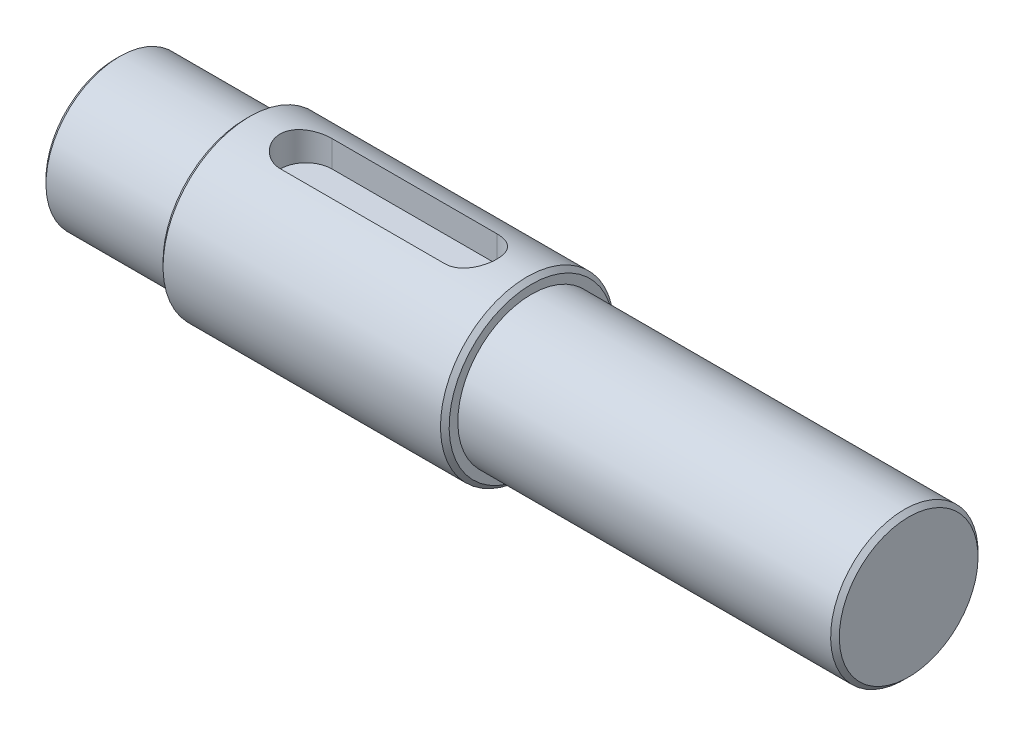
ISO-10303-21;
HEADER;
FILE_DESCRIPTION(('STEP AP214'),'2;1');
FILE_NAME('part.step','',(''),(''),'','','');
FILE_SCHEMA(('AUTOMOTIVE_DESIGN { 1 0 10303 214 1 1 1 1 }'));
ENDSEC;
DATA;
#1=APPLICATION_CONTEXT('core data for automotive mechanical design processes');
#2=APPLICATION_PROTOCOL_DEFINITION('international standard','automotive_design',2000,#1);
#3=PRODUCT_CONTEXT('',#1,'mechanical');
#4=PRODUCT('Part','Part','',(#3));
#5=PRODUCT_RELATED_PRODUCT_CATEGORY('part','',(#4));
#6=PRODUCT_DEFINITION_FORMATION('','',#4);
#7=PRODUCT_DEFINITION_CONTEXT('part definition',#1,'design');
#8=PRODUCT_DEFINITION('design','',#6,#7);
#9=PRODUCT_DEFINITION_SHAPE('','',#8);
#10=(LENGTH_UNIT() NAMED_UNIT(*) SI_UNIT(.MILLI.,.METRE.));
#11=(NAMED_UNIT(*) PLANE_ANGLE_UNIT() SI_UNIT($,.RADIAN.));
#12=(NAMED_UNIT(*) SI_UNIT($,.STERADIAN.) SOLID_ANGLE_UNIT());
#13=UNCERTAINTY_MEASURE_WITH_UNIT(LENGTH_MEASURE(1.E-05),#10,'distance_accuracy_value','');
#14=(GEOMETRIC_REPRESENTATION_CONTEXT(3) GLOBAL_UNCERTAINTY_ASSIGNED_CONTEXT((#13)) GLOBAL_UNIT_ASSIGNED_CONTEXT((#10,
#11,#12)) REPRESENTATION_CONTEXT('',''));
#15=CARTESIAN_POINT('',(0.,0.,0.));
#16=DIRECTION('',(0.,0.,1.));
#17=DIRECTION('',(1.,0.,0.));
#18=AXIS2_PLACEMENT_3D('',#15,#16,#17);
#19=CARTESIAN_POINT('',(91.5,0.,0.));
#20=DIRECTION('',(1.,0.,0.));
#21=DIRECTION('',(0.,1.,0.));
#22=AXIS2_PLACEMENT_3D('',#19,#20,#21);
#23=CYLINDRICAL_SURFACE('',#22,9.99999999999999);
#24=CARTESIAN_POINT('',(15.5,0.,0.));
#25=DIRECTION('',(1.,0.,0.));
#26=DIRECTION('',(0.,1.,0.));
#27=AXIS2_PLACEMENT_3D('',#24,#25,#26);
#28=CIRCLE('',#27,9.99999999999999);
#29=CARTESIAN_POINT('',(15.5,9.99999999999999,0.));
#30=VERTEX_POINT('',#29);
#31=EDGE_CURVE('E192',#30,#30,#28,.T.);
#32=ORIENTED_EDGE('',*,*,#31,.T.);
#33=EDGE_LOOP('',(#32));
#34=FACE_BOUND('',#33,.T.);
#35=CARTESIAN_POINT('',(47.5,0.,0.));
#36=DIRECTION('',(1.,0.,0.));
#37=DIRECTION('',(0.,1.,0.));
#38=AXIS2_PLACEMENT_3D('',#35,#36,#37);
#39=CIRCLE('',#38,9.99999999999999);
#40=CARTESIAN_POINT('',(47.5,9.99999999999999,0.));
#41=VERTEX_POINT('',#40);
#42=EDGE_CURVE('E195',#41,#41,#39,.T.);
#43=ORIENTED_EDGE('',*,*,#42,.F.);
#44=EDGE_LOOP('',(#43));
#45=FACE_BOUND('',#44,.T.);
#46=DIRECTION('',(1.,0.,0.));
#47=VECTOR('',#46,1.);
#48=CARTESIAN_POINT('',(91.5,9.53939201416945,2.99999999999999));
#49=LINE('',#48,#47);
#50=CARTESIAN_POINT('',(22.,9.53939201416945,3.));
#51=VERTEX_POINT('',#50);
#52=CARTESIAN_POINT('',(41.,9.53939201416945,3.));
#53=VERTEX_POINT('',#52);
#54=EDGE_CURVE('E109',#51,#53,#49,.T.);
#55=ORIENTED_EDGE('',*,*,#54,.F.);
#56=CARTESIAN_POINT('',(22.,9.53939201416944,-3.));
#57=CARTESIAN_POINT('',(21.9176644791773,9.53938054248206,-3.00001027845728));
#58=CARTESIAN_POINT('',(21.8353355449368,9.54045772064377,-2.99661062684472));
#59=CARTESIAN_POINT('',(21.6713060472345,9.54470412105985,-2.98307142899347));
#60=CARTESIAN_POINT('',(21.5896053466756,9.54787287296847,-2.97293339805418));
#61=CARTESIAN_POINT('',(21.4276150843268,9.55620668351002,-2.94603140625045));
#62=CARTESIAN_POINT('',(21.347322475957,9.56136667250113,-2.92928426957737));
#63=CARTESIAN_POINT('',(21.1885241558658,9.57351626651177,-2.88932853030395));
#64=CARTESIAN_POINT('',(21.1100184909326,9.58050591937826,-2.86611975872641));
#65=CARTESIAN_POINT('',(20.8780506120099,9.60391637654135,-2.78708584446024));
#66=CARTESIAN_POINT('',(20.727931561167,9.62279007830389,-2.72181852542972));
#67=CARTESIAN_POINT('',(20.440773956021,9.66493213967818,-2.56815043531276));
#68=CARTESIAN_POINT('',(20.3037415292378,9.6882025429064,-2.4797388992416));
#69=CARTESIAN_POINT('',(20.0422770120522,9.73733650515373,-2.27929879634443));
#70=CARTESIAN_POINT('',(19.9183151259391,9.76325505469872,-2.16666914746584));
#71=CARTESIAN_POINT('',(19.6907263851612,9.81429628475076,-1.92227736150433));
#72=CARTESIAN_POINT('',(19.587102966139,9.83941883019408,-1.79051199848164));
#73=CARTESIAN_POINT('',(19.4010731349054,9.88666477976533,-1.50821997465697));
#74=CARTESIAN_POINT('',(19.3191498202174,9.90871541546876,-1.35736167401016));
#75=CARTESIAN_POINT('',(19.1820229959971,9.94668940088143,-1.04324233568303));
#76=CARTESIAN_POINT('',(19.126812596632,9.96261433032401,-0.879984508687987));
#77=CARTESIAN_POINT('',(19.046240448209,9.98615279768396,-0.550649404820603));
#78=CARTESIAN_POINT('',(19.0200702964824,9.99399098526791,-0.384786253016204));
#79=CARTESIAN_POINT('',(18.995765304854,10.0012640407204,-0.0508471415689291));
#80=CARTESIAN_POINT('',(18.9976251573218,10.0007004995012,0.117228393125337));
#81=CARTESIAN_POINT('',(19.0287858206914,9.99139205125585,0.445143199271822));
#82=CARTESIAN_POINT('',(19.0572106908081,9.98290831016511,0.605074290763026));
#83=CARTESIAN_POINT('',(19.1392632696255,9.95903027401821,0.917780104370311));
#84=CARTESIAN_POINT('',(19.1928922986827,9.94363561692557,1.07055445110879));
#85=CARTESIAN_POINT('',(19.3244244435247,9.90730429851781,1.36669563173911));
#86=CARTESIAN_POINT('',(19.4026032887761,9.88630511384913,1.50993201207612));
#87=CARTESIAN_POINT('',(19.5807971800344,9.84099249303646,1.781531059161));
#88=CARTESIAN_POINT('',(19.6808171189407,9.81667831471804,1.9098903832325));
#89=CARTESIAN_POINT('',(19.9043839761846,9.76623347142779,2.15330901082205));
#90=CARTESIAN_POINT('',(20.0286877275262,9.74006890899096,2.26766702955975));
#91=CARTESIAN_POINT('',(20.2949948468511,9.68968430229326,2.47413538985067));
#92=CARTESIAN_POINT('',(20.4370033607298,9.66546482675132,2.5662392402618));
#93=CARTESIAN_POINT('',(20.7365618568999,9.62154457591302,2.72632814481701));
#94=CARTESIAN_POINT('',(20.8942543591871,9.60189192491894,2.79406012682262));
#95=CARTESIAN_POINT('',(21.2194490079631,9.56991327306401,2.90171772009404));
#96=CARTESIAN_POINT('',(21.3869357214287,9.55757606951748,2.94168586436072));
#97=CARTESIAN_POINT('',(21.6299897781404,9.5462806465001,2.97802407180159));
#98=CARTESIAN_POINT('',(21.7037814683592,9.54370312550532,2.98626405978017));
#99=CARTESIAN_POINT('',(21.851702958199,9.54025857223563,2.99724711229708));
#100=CARTESIAN_POINT('',(21.9258320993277,9.53938902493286,2.99999825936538));
#101=CARTESIAN_POINT('',(22.,9.53939201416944,3.));
#102=B_SPLINE_CURVE_WITH_KNOTS('',3,(#56,#57,#58,#59,#60,#61,#62,#63,#64,#65,#66,#67,#68,#69,
#70,#71,#72,#73,#74,#75,#76,#77,#78,#79,#80,#81,#82,#83,#84,#85,#86,#87,#88,#89,#90,#91,#92,#93,
#94,#95,#96,#97,#98,#99,#100,#101),.UNSPECIFIED.,.F.,.F.,(4,2,2,2,2,2,2,2,2,2,2,2,2,2,2,2,2,2,2,
2,2,2,4),(0.,0.246918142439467,0.493780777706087,0.740019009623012,0.986263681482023,
1.47813347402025,1.97023245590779,2.47635119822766,2.98255536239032,3.4992281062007,
4.01576751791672,4.51753600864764,5.019209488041,5.50490358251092,5.99062312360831,
6.48200583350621,6.97349873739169,7.48389234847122,7.99443465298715,8.51013494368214,
9.02504345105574,9.24774267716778,9.47011372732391),.UNSPECIFIED.);
#103=CARTESIAN_POINT('',(22.,9.53939201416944,-3.00000000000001));
#104=VERTEX_POINT('',#103);
#105=EDGE_CURVE('E91',#104,#51,#102,.T.);
#106=ORIENTED_EDGE('',*,*,#105,.F.);
#107=DIRECTION('',(1.,0.,0.));
#108=VECTOR('',#107,1.);
#109=CARTESIAN_POINT('',(91.5,9.53939201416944,-3.00000000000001));
#110=LINE('',#109,#108);
#111=CARTESIAN_POINT('',(41.,9.53939201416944,-3.00000000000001));
#112=VERTEX_POINT('',#111);
#113=EDGE_CURVE('E103',#112,#104,#110,.F.);
#114=ORIENTED_EDGE('',*,*,#113,.F.);
#115=CARTESIAN_POINT('',(41.,9.53939201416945,3.));
#116=CARTESIAN_POINT('',(41.0823355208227,9.53938054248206,3.00001027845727));
#117=CARTESIAN_POINT('',(41.1646644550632,9.54045772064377,2.99661062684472));
#118=CARTESIAN_POINT('',(41.3286939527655,9.54470412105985,2.98307142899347));
#119=CARTESIAN_POINT('',(41.4103946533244,9.54787287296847,2.97293339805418));
#120=CARTESIAN_POINT('',(41.5723849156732,9.55620668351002,2.94603140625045));
#121=CARTESIAN_POINT('',(41.652677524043,9.56136667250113,2.92928426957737));
#122=CARTESIAN_POINT('',(41.8114758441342,9.57351626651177,2.88932853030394));
#123=CARTESIAN_POINT('',(41.8899815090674,9.58050591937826,2.8661197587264));
#124=CARTESIAN_POINT('',(42.1219493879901,9.60391637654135,2.78708584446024));
#125=CARTESIAN_POINT('',(42.272068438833,9.6227900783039,2.72181852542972));
#126=CARTESIAN_POINT('',(42.559226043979,9.66493213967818,2.56815043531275));
#127=CARTESIAN_POINT('',(42.6962584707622,9.6882025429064,2.47973889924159));
#128=CARTESIAN_POINT('',(42.9577229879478,9.73733650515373,2.27929879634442));
#129=CARTESIAN_POINT('',(43.0816848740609,9.76325505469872,2.16666914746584));
#130=CARTESIAN_POINT('',(43.3092736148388,9.81429628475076,1.92227736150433));
#131=CARTESIAN_POINT('',(43.412897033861,9.83941883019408,1.79051199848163));
#132=CARTESIAN_POINT('',(43.5989268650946,9.88666477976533,1.50821997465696));
#133=CARTESIAN_POINT('',(43.6808501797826,9.90871541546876,1.35736167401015));
#134=CARTESIAN_POINT('',(43.8179770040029,9.94668940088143,1.04324233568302));
#135=CARTESIAN_POINT('',(43.873187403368,9.96261433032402,0.879984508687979));
#136=CARTESIAN_POINT('',(43.953759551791,9.98615279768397,0.550649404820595));
#137=CARTESIAN_POINT('',(43.9799297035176,9.99399098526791,0.384786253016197));
#138=CARTESIAN_POINT('',(44.004234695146,10.0012640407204,0.0508471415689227));
#139=CARTESIAN_POINT('',(44.0023748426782,10.0007004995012,-0.117228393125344));
#140=CARTESIAN_POINT('',(43.9712141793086,9.99139205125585,-0.445143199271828));
#141=CARTESIAN_POINT('',(43.9427893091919,9.98290831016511,-0.605074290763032));
#142=CARTESIAN_POINT('',(43.8607367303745,9.95903027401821,-0.917780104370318));
#143=CARTESIAN_POINT('',(43.8071077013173,9.94363561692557,-1.07055445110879));
#144=CARTESIAN_POINT('',(43.6755755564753,9.90730429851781,-1.36669563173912));
#145=CARTESIAN_POINT('',(43.5973967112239,9.88630511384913,-1.50993201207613));
#146=CARTESIAN_POINT('',(43.4192028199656,9.84099249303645,-1.78153105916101));
#147=CARTESIAN_POINT('',(43.3191828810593,9.81667831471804,-1.90989038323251));
#148=CARTESIAN_POINT('',(43.0956160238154,9.76623347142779,-2.15330901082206));
#149=CARTESIAN_POINT('',(42.9713122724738,9.74006890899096,-2.26766702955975));
#150=CARTESIAN_POINT('',(42.7050051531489,9.68968430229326,-2.47413538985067));
#151=CARTESIAN_POINT('',(42.5629966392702,9.66546482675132,-2.5662392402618));
#152=CARTESIAN_POINT('',(42.2634381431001,9.62154457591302,-2.72632814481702));
#153=CARTESIAN_POINT('',(42.1057456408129,9.60189192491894,-2.79406012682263));
#154=CARTESIAN_POINT('',(41.7805509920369,9.56991327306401,-2.90171772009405));
#155=CARTESIAN_POINT('',(41.6130642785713,9.55757606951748,-2.94168586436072));
#156=CARTESIAN_POINT('',(41.3700102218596,9.5462806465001,-2.97802407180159));
#157=CARTESIAN_POINT('',(41.2962185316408,9.54370312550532,-2.98626405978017));
#158=CARTESIAN_POINT('',(41.148297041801,9.54025857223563,-2.99724711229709));
#159=CARTESIAN_POINT('',(41.0741679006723,9.53938902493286,-2.99999825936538));
#160=CARTESIAN_POINT('',(41.,9.53939201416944,-3.));
#161=B_SPLINE_CURVE_WITH_KNOTS('',3,(#115,#116,#117,#118,#119,#120,#121,#122,#123,#124,#125,
#126,#127,#128,#129,#130,#131,#132,#133,#134,#135,#136,#137,#138,#139,#140,#141,#142,#143,#144,
#145,#146,#147,#148,#149,#150,#151,#152,#153,#154,#155,#156,#157,#158,#159,#160),.UNSPECIFIED.,
.F.,.F.,(4,2,2,2,2,2,2,2,2,2,2,2,2,2,2,2,2,2,2,2,2,2,4),(0.,0.246918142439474,0.493780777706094,
0.740019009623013,0.986263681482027,1.47813347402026,1.97023245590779,2.47635119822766,
2.98255536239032,3.49922810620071,4.01576751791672,4.51753600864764,5.019209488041,
5.50490358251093,5.99062312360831,6.48200583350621,6.9734987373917,7.48389234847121,
7.99443465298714,8.51013494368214,9.02504345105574,9.24774267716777,9.47011372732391),.UNSPECIFIED.);
#162=EDGE_CURVE('E61',#53,#112,#161,.T.);
#163=ORIENTED_EDGE('',*,*,#162,.F.);
#164=EDGE_LOOP('',(#55,#106,#114,#163));
#165=FACE_BOUND('',#164,.T.);
#166=ADVANCED_FACE('F45',(#34,#45,#165),#23,.T.);
#167=CARTESIAN_POINT('',(0.,0.,0.));
#168=DIRECTION('',(-1.,0.,0.));
#169=DIRECTION('',(0.,-1.,0.));
#170=AXIS2_PLACEMENT_3D('',#167,#168,#169);
#171=PLANE('',#170);
#172=CARTESIAN_POINT('',(0.,0.,0.));
#173=DIRECTION('',(1.,0.,0.));
#174=DIRECTION('',(0.,1.,0.));
#175=AXIS2_PLACEMENT_3D('',#172,#173,#174);
#176=CIRCLE('',#175,8.);
#177=CARTESIAN_POINT('',(0.,8.,0.));
#178=VERTEX_POINT('',#177);
#179=EDGE_CURVE('E11',#178,#178,#176,.T.);
#180=ORIENTED_EDGE('',*,*,#179,.F.);
#181=EDGE_LOOP('',(#180));
#182=FACE_BOUND('',#181,.T.);
#183=ADVANCED_FACE('F47',(#182),#171,.T.);
#184=CARTESIAN_POINT('',(0.5,0.,0.));
#185=DIRECTION('',(1.,0.,0.));
#186=DIRECTION('',(0.,1.,0.));
#187=AXIS2_PLACEMENT_3D('',#184,#185,#186);
#188=CONICAL_SURFACE('',#187,8.5,0.785398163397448);
#189=ORIENTED_EDGE('',*,*,#179,.T.);
#190=EDGE_LOOP('',(#189));
#191=FACE_BOUND('',#190,.T.);
#192=CARTESIAN_POINT('',(0.5,0.,0.));
#193=DIRECTION('',(1.,0.,0.));
#194=DIRECTION('',(0.,1.,0.));
#195=AXIS2_PLACEMENT_3D('',#192,#193,#194);
#196=CIRCLE('',#195,8.5);
#197=CARTESIAN_POINT('',(0.5,8.5,0.));
#198=VERTEX_POINT('',#197);
#199=EDGE_CURVE('E54',#198,#198,#196,.T.);
#200=ORIENTED_EDGE('',*,*,#199,.F.);
#201=EDGE_LOOP('',(#200));
#202=FACE_BOUND('',#201,.T.);
#203=ADVANCED_FACE('F155',(#191,#202),#188,.T.);
#204=CARTESIAN_POINT('',(91.5,0.,0.));
#205=DIRECTION('',(1.,0.,0.));
#206=DIRECTION('',(0.,1.,0.));
#207=AXIS2_PLACEMENT_3D('',#204,#205,#206);
#208=CYLINDRICAL_SURFACE('',#207,8.5);
#209=ORIENTED_EDGE('',*,*,#199,.T.);
#210=EDGE_LOOP('',(#209));
#211=FACE_BOUND('',#210,.T.);
#212=CARTESIAN_POINT('',(15.,0.,0.));
#213=DIRECTION('',(1.,0.,0.));
#214=DIRECTION('',(0.,1.,0.));
#215=AXIS2_PLACEMENT_3D('',#212,#213,#214);
#216=CIRCLE('',#215,8.5);
#217=CARTESIAN_POINT('',(15.,8.5,0.));
#218=VERTEX_POINT('',#217);
#219=EDGE_CURVE('E183',#218,#218,#216,.T.);
#220=ORIENTED_EDGE('',*,*,#219,.F.);
#221=EDGE_LOOP('',(#220));
#222=FACE_BOUND('',#221,.T.);
#223=ADVANCED_FACE('F170',(#211,#222),#208,.T.);
#224=CARTESIAN_POINT('',(15.,8.5,0.));
#225=DIRECTION('',(-1.,0.,0.));
#226=DIRECTION('',(0.,-1.,0.));
#227=AXIS2_PLACEMENT_3D('',#224,#225,#226);
#228=PLANE('',#227);
#229=ORIENTED_EDGE('',*,*,#219,.T.);
#230=EDGE_LOOP('',(#229));
#231=FACE_BOUND('',#230,.T.);
#232=CARTESIAN_POINT('',(15.,0.,0.));
#233=DIRECTION('',(1.,0.,0.));
#234=DIRECTION('',(0.,1.,0.));
#235=AXIS2_PLACEMENT_3D('',#232,#233,#234);
#236=CIRCLE('',#235,9.49999999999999);
#237=CARTESIAN_POINT('',(15.,9.49999999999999,0.));
#238=VERTEX_POINT('',#237);
#239=EDGE_CURVE('E186',#238,#238,#236,.T.);
#240=ORIENTED_EDGE('',*,*,#239,.F.);
#241=EDGE_LOOP('',(#240));
#242=FACE_BOUND('',#241,.T.);
#243=ADVANCED_FACE('F166',(#231,#242),#228,.T.);
#244=CARTESIAN_POINT('',(15.5,0.,0.));
#245=DIRECTION('',(1.,0.,0.));
#246=DIRECTION('',(0.,1.,0.));
#247=AXIS2_PLACEMENT_3D('',#244,#245,#246);
#248=CONICAL_SURFACE('',#247,9.99999999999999,0.785398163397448);
#249=ORIENTED_EDGE('',*,*,#239,.T.);
#250=EDGE_LOOP('',(#249));
#251=FACE_BOUND('',#250,.T.);
#252=ORIENTED_EDGE('',*,*,#31,.F.);
#253=EDGE_LOOP('',(#252));
#254=FACE_BOUND('',#253,.T.);
#255=ADVANCED_FACE('F163',(#251,#254),#248,.T.);
#256=CARTESIAN_POINT('',(48.,0.,0.));
#257=DIRECTION('',(-1.,0.,0.));
#258=DIRECTION('',(0.,-1.,0.));
#259=AXIS2_PLACEMENT_3D('',#256,#257,#258);
#260=CONICAL_SURFACE('',#259,9.49999999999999,0.785398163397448);
#261=ORIENTED_EDGE('',*,*,#42,.T.);
#262=EDGE_LOOP('',(#261));
#263=FACE_BOUND('',#262,.T.);
#264=CARTESIAN_POINT('',(48.,0.,0.));
#265=DIRECTION('',(1.,0.,0.));
#266=DIRECTION('',(0.,1.,0.));
#267=AXIS2_PLACEMENT_3D('',#264,#265,#266);
#268=CIRCLE('',#267,9.49999999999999);
#269=CARTESIAN_POINT('',(48.,9.49999999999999,0.));
#270=VERTEX_POINT('',#269);
#271=EDGE_CURVE('E199',#270,#270,#268,.T.);
#272=ORIENTED_EDGE('',*,*,#271,.F.);
#273=EDGE_LOOP('',(#272));
#274=FACE_BOUND('',#273,.T.);
#275=ADVANCED_FACE('F161',(#263,#274),#260,.T.);
#276=CARTESIAN_POINT('',(48.,9.49999999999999,0.));
#277=DIRECTION('',(1.,0.,0.));
#278=DIRECTION('',(0.,1.,0.));
#279=AXIS2_PLACEMENT_3D('',#276,#277,#278);
#280=PLANE('',#279);
#281=ORIENTED_EDGE('',*,*,#271,.T.);
#282=EDGE_LOOP('',(#281));
#283=FACE_BOUND('',#282,.T.);
#284=CARTESIAN_POINT('',(48.,0.,0.));
#285=DIRECTION('',(1.,0.,0.));
#286=DIRECTION('',(0.,1.,0.));
#287=AXIS2_PLACEMENT_3D('',#284,#285,#286);
#288=CIRCLE('',#287,8.50000000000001);
#289=CARTESIAN_POINT('',(48.,8.50000000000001,0.));
#290=VERTEX_POINT('',#289);
#291=EDGE_CURVE('E203',#290,#290,#288,.T.);
#292=ORIENTED_EDGE('',*,*,#291,.F.);
#293=EDGE_LOOP('',(#292));
#294=FACE_BOUND('',#293,.T.);
#295=ADVANCED_FACE('F283',(#283,#294),#280,.T.);
#296=CARTESIAN_POINT('',(91.5,0.,0.));
#297=DIRECTION('',(1.,0.,0.));
#298=DIRECTION('',(0.,1.,0.));
#299=AXIS2_PLACEMENT_3D('',#296,#297,#298);
#300=CYLINDRICAL_SURFACE('',#299,8.50000000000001);
#301=ORIENTED_EDGE('',*,*,#291,.T.);
#302=EDGE_LOOP('',(#301));
#303=FACE_BOUND('',#302,.T.);
#304=CARTESIAN_POINT('',(91.,0.,0.));
#305=DIRECTION('',(1.,0.,0.));
#306=DIRECTION('',(0.,1.,0.));
#307=AXIS2_PLACEMENT_3D('',#304,#305,#306);
#308=CIRCLE('',#307,8.50000000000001);
#309=CARTESIAN_POINT('',(91.,8.50000000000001,0.));
#310=VERTEX_POINT('',#309);
#311=EDGE_CURVE('E207',#310,#310,#308,.T.);
#312=ORIENTED_EDGE('',*,*,#311,.F.);
#313=EDGE_LOOP('',(#312));
#314=FACE_BOUND('',#313,.T.);
#315=ADVANCED_FACE('F273',(#303,#314),#300,.T.);
#316=CARTESIAN_POINT('',(91.5,0.,0.));
#317=DIRECTION('',(-1.,0.,0.));
#318=DIRECTION('',(0.,-1.,0.));
#319=AXIS2_PLACEMENT_3D('',#316,#317,#318);
#320=CONICAL_SURFACE('',#319,8.00000000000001,0.785398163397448);
#321=ORIENTED_EDGE('',*,*,#311,.T.);
#322=EDGE_LOOP('',(#321));
#323=FACE_BOUND('',#322,.T.);
#324=CARTESIAN_POINT('',(91.5,0.,0.));
#325=DIRECTION('',(1.,0.,0.));
#326=DIRECTION('',(0.,1.,0.));
#327=AXIS2_PLACEMENT_3D('',#324,#325,#326);
#328=CIRCLE('',#327,8.00000000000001);
#329=CARTESIAN_POINT('',(91.5,8.00000000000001,0.));
#330=VERTEX_POINT('',#329);
#331=EDGE_CURVE('E107',#330,#330,#328,.T.);
#332=ORIENTED_EDGE('',*,*,#331,.F.);
#333=EDGE_LOOP('',(#332));
#334=FACE_BOUND('',#333,.T.);
#335=ADVANCED_FACE('F264',(#323,#334),#320,.T.);
#336=CARTESIAN_POINT('',(91.5,8.00000000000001,0.));
#337=DIRECTION('',(1.,0.,0.));
#338=DIRECTION('',(0.,1.,0.));
#339=AXIS2_PLACEMENT_3D('',#336,#337,#338);
#340=PLANE('',#339);
#341=ORIENTED_EDGE('',*,*,#331,.T.);
#342=EDGE_LOOP('',(#341));
#343=FACE_BOUND('',#342,.T.);
#344=ADVANCED_FACE('F147',(#343),#340,.T.);
#345=CARTESIAN_POINT('',(22.,10.001,0.));
#346=DIRECTION('',(0.,-1.,0.));
#347=DIRECTION('',(0.,0.,-1.));
#348=AXIS2_PLACEMENT_3D('',#345,#346,#347);
#349=CYLINDRICAL_SURFACE('',#348,3.);
#350=ORIENTED_EDGE('',*,*,#105,.T.);
#351=DIRECTION('',(0.,-1.,0.));
#352=VECTOR('',#351,1.);
#353=CARTESIAN_POINT('',(22.,10.001,3.));
#354=LINE('',#353,#352);
#355=CARTESIAN_POINT('',(22.,6.5,3.));
#356=VERTEX_POINT('',#355);
#357=EDGE_CURVE('E69',#51,#356,#354,.T.);
#358=ORIENTED_EDGE('',*,*,#357,.T.);
#359=CARTESIAN_POINT('',(22.,6.5,0.));
#360=DIRECTION('',(0.,1.,0.));
#361=DIRECTION('',(0.,0.,1.));
#362=AXIS2_PLACEMENT_3D('',#359,#360,#361);
#363=CIRCLE('',#362,3.);
#364=CARTESIAN_POINT('',(22.,6.5,-3.));
#365=VERTEX_POINT('',#364);
#366=EDGE_CURVE('E94',#365,#356,#363,.T.);
#367=ORIENTED_EDGE('',*,*,#366,.F.);
#368=DIRECTION('',(0.,-1.,0.));
#369=VECTOR('',#368,1.);
#370=CARTESIAN_POINT('',(22.,10.001,-3.));
#371=LINE('',#370,#369);
#372=EDGE_CURVE('E87',#104,#365,#371,.T.);
#373=ORIENTED_EDGE('',*,*,#372,.F.);
#374=EDGE_LOOP('',(#350,#358,#367,#373));
#375=FACE_BOUND('',#374,.T.);
#376=ADVANCED_FACE('F89',(#375),#349,.F.);
#377=CARTESIAN_POINT('',(22.,10.001,3.));
#378=DIRECTION('',(0.,0.,-1.));
#379=DIRECTION('',(-1.,0.,0.));
#380=AXIS2_PLACEMENT_3D('',#377,#378,#379);
#381=PLANE('',#380);
#382=ORIENTED_EDGE('',*,*,#54,.T.);
#383=DIRECTION('',(0.,-1.,0.));
#384=VECTOR('',#383,1.);
#385=CARTESIAN_POINT('',(41.,10.001,3.));
#386=LINE('',#385,#384);
#387=CARTESIAN_POINT('',(41.,6.5,3.));
#388=VERTEX_POINT('',#387);
#389=EDGE_CURVE('E216',#53,#388,#386,.T.);
#390=ORIENTED_EDGE('',*,*,#389,.T.);
#391=DIRECTION('',(1.,0.,0.));
#392=VECTOR('',#391,1.);
#393=CARTESIAN_POINT('',(22.,6.5,3.));
#394=LINE('',#393,#392);
#395=EDGE_CURVE('E114',#356,#388,#394,.T.);
#396=ORIENTED_EDGE('',*,*,#395,.F.);
#397=ORIENTED_EDGE('',*,*,#357,.F.);
#398=EDGE_LOOP('',(#382,#390,#396,#397));
#399=FACE_BOUND('',#398,.T.);
#400=ADVANCED_FACE('F142',(#399),#381,.T.);
#401=CARTESIAN_POINT('',(41.,10.001,0.));
#402=DIRECTION('',(0.,-1.,0.));
#403=DIRECTION('',(0.,0.,-1.));
#404=AXIS2_PLACEMENT_3D('',#401,#402,#403);
#405=CYLINDRICAL_SURFACE('',#404,3.);
#406=ORIENTED_EDGE('',*,*,#162,.T.);
#407=DIRECTION('',(0.,-1.,0.));
#408=VECTOR('',#407,1.);
#409=CARTESIAN_POINT('',(41.,10.001,-3.));
#410=LINE('',#409,#408);
#411=CARTESIAN_POINT('',(41.,6.5,-3.));
#412=VERTEX_POINT('',#411);
#413=EDGE_CURVE('E99',#112,#412,#410,.T.);
#414=ORIENTED_EDGE('',*,*,#413,.T.);
#415=CARTESIAN_POINT('',(41.,6.5,0.));
#416=DIRECTION('',(0.,1.,0.));
#417=DIRECTION('',(0.,0.,1.));
#418=AXIS2_PLACEMENT_3D('',#415,#416,#417);
#419=CIRCLE('',#418,3.);
#420=EDGE_CURVE('E223',#388,#412,#419,.T.);
#421=ORIENTED_EDGE('',*,*,#420,.F.);
#422=ORIENTED_EDGE('',*,*,#389,.F.);
#423=EDGE_LOOP('',(#406,#414,#421,#422));
#424=FACE_BOUND('',#423,.T.);
#425=ADVANCED_FACE('F139',(#424),#405,.F.);
#426=CARTESIAN_POINT('',(22.,10.001,-3.));
#427=DIRECTION('',(0.,0.,1.));
#428=DIRECTION('',(1.,0.,0.));
#429=AXIS2_PLACEMENT_3D('',#426,#427,#428);
#430=PLANE('',#429);
#431=ORIENTED_EDGE('',*,*,#113,.T.);
#432=ORIENTED_EDGE('',*,*,#372,.T.);
#433=DIRECTION('',(-1.,0.,0.));
#434=VECTOR('',#433,1.);
#435=CARTESIAN_POINT('',(22.,6.5,-3.));
#436=LINE('',#435,#434);
#437=EDGE_CURVE('E100',#412,#365,#436,.T.);
#438=ORIENTED_EDGE('',*,*,#437,.F.);
#439=ORIENTED_EDGE('',*,*,#413,.F.);
#440=EDGE_LOOP('',(#431,#432,#438,#439));
#441=FACE_BOUND('',#440,.T.);
#442=ADVANCED_FACE('F104',(#441),#430,.T.);
#443=CARTESIAN_POINT('',(22.,6.5,0.));
#444=DIRECTION('',(0.,1.,0.));
#445=DIRECTION('',(0.,0.,1.));
#446=AXIS2_PLACEMENT_3D('',#443,#444,#445);
#447=PLANE('',#446);
#448=ORIENTED_EDGE('',*,*,#366,.T.);
#449=ORIENTED_EDGE('',*,*,#395,.T.);
#450=ORIENTED_EDGE('',*,*,#420,.T.);
#451=ORIENTED_EDGE('',*,*,#437,.T.);
#452=EDGE_LOOP('',(#448,#449,#450,#451));
#453=FACE_BOUND('',#452,.T.);
#454=ADVANCED_FACE('F130',(#453),#447,.T.);
#455=CLOSED_SHELL('',(#166,#183,#203,#223,#243,#255,#275,#295,#315,#335,#344,#376,#400,#425,
#442,#454));
#456=MANIFOLD_SOLID_BREP('B2',#455);
#457=ADVANCED_BREP_SHAPE_REPRESENTATION('',(#18,#456),#14);
#458=SHAPE_DEFINITION_REPRESENTATION(#9,#457);
ENDSEC;
END-ISO-10303-21;
